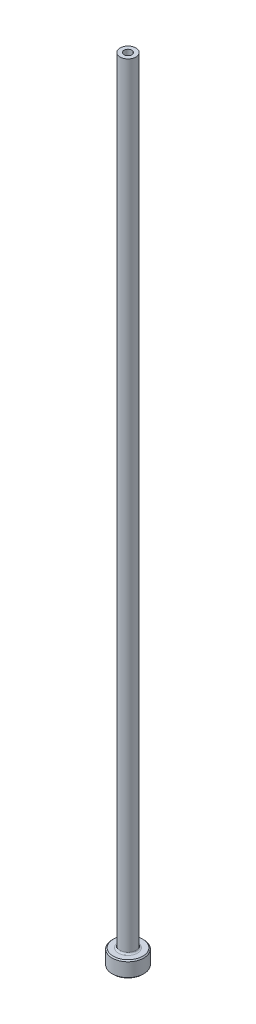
ISO-10303-21;
HEADER;
FILE_DESCRIPTION(('STEP AP214'),'2;1');
FILE_NAME('part.step','',(''),(''),'','','');
FILE_SCHEMA(('AUTOMOTIVE_DESIGN { 1 0 10303 214 1 1 1 1 }'));
ENDSEC;
DATA;
#1=APPLICATION_CONTEXT('core data for automotive mechanical design processes');
#2=APPLICATION_PROTOCOL_DEFINITION('international standard','automotive_design',2000,#1);
#3=PRODUCT_CONTEXT('',#1,'mechanical');
#4=PRODUCT('Part','Part','',(#3));
#5=PRODUCT_RELATED_PRODUCT_CATEGORY('part','',(#4));
#6=PRODUCT_DEFINITION_FORMATION('','',#4);
#7=PRODUCT_DEFINITION_CONTEXT('part definition',#1,'design');
#8=PRODUCT_DEFINITION('design','',#6,#7);
#9=PRODUCT_DEFINITION_SHAPE('','',#8);
#10=(LENGTH_UNIT() NAMED_UNIT(*) SI_UNIT(.MILLI.,.METRE.));
#11=(NAMED_UNIT(*) PLANE_ANGLE_UNIT() SI_UNIT($,.RADIAN.));
#12=(NAMED_UNIT(*) SI_UNIT($,.STERADIAN.) SOLID_ANGLE_UNIT());
#13=UNCERTAINTY_MEASURE_WITH_UNIT(LENGTH_MEASURE(1.E-05),#10,'distance_accuracy_value','');
#14=(GEOMETRIC_REPRESENTATION_CONTEXT(3) GLOBAL_UNCERTAINTY_ASSIGNED_CONTEXT((#13)) GLOBAL_UNIT_ASSIGNED_CONTEXT((#10,
#11,#12)) REPRESENTATION_CONTEXT('',''));
#15=CARTESIAN_POINT('',(0.,0.,0.));
#16=DIRECTION('',(0.,0.,1.));
#17=DIRECTION('',(1.,0.,0.));
#18=AXIS2_PLACEMENT_3D('',#15,#16,#17);
#19=CARTESIAN_POINT('',(0.,92.1876809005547,0.));
#20=DIRECTION('',(0.,1.,0.));
#21=DIRECTION('',(0.,0.,1.));
#22=AXIS2_PLACEMENT_3D('',#19,#20,#21);
#23=CYLINDRICAL_SURFACE('',#22,0.75);
#24=CARTESIAN_POINT('',(0.,150.,0.));
#25=DIRECTION('',(0.,1.,0.));
#26=DIRECTION('',(0.,0.,1.));
#27=AXIS2_PLACEMENT_3D('',#24,#25,#26);
#28=CIRCLE('',#27,0.75);
#29=CARTESIAN_POINT('',(0.,150.,0.75));
#30=VERTEX_POINT('',#29);
#31=EDGE_CURVE('E62',#30,#30,#28,.T.);
#32=ORIENTED_EDGE('',*,*,#31,.T.);
#33=EDGE_LOOP('',(#32));
#34=FACE_BOUND('',#33,.T.);
#35=CARTESIAN_POINT('',(0.,115.,0.));
#36=DIRECTION('',(0.,1.,0.));
#37=DIRECTION('',(0.,0.,1.));
#38=AXIS2_PLACEMENT_3D('',#35,#36,#37);
#39=CIRCLE('',#38,0.75);
#40=CARTESIAN_POINT('',(0.,115.,0.75));
#41=VERTEX_POINT('',#40);
#42=EDGE_CURVE('E71',#41,#41,#39,.T.);
#43=ORIENTED_EDGE('',*,*,#42,.F.);
#44=EDGE_LOOP('',(#43));
#45=FACE_BOUND('',#44,.T.);
#46=ADVANCED_FACE('F30',(#34,#45),#23,.F.);
#47=CARTESIAN_POINT('',(-0.75,150.,0.));
#48=DIRECTION('',(0.,1.,0.));
#49=DIRECTION('',(0.,0.,1.));
#50=AXIS2_PLACEMENT_3D('',#47,#48,#49);
#51=PLANE('',#50);
#52=CARTESIAN_POINT('',(0.,150.,0.));
#53=DIRECTION('',(0.,1.,0.));
#54=DIRECTION('',(0.,0.,1.));
#55=AXIS2_PLACEMENT_3D('',#52,#53,#54);
#56=CIRCLE('',#55,1.50000000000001);
#57=CARTESIAN_POINT('',(0.,150.,1.50000000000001));
#58=VERTEX_POINT('',#57);
#59=EDGE_CURVE('E65',#58,#58,#56,.T.);
#60=ORIENTED_EDGE('',*,*,#59,.T.);
#61=EDGE_LOOP('',(#60));
#62=FACE_BOUND('',#61,.T.);
#63=ORIENTED_EDGE('',*,*,#31,.F.);
#64=EDGE_LOOP('',(#63));
#65=FACE_BOUND('',#64,.T.);
#66=ADVANCED_FACE('F79',(#62,#65),#51,.T.);
#67=CARTESIAN_POINT('',(0.,92.1876809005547,0.));
#68=DIRECTION('',(0.,1.,0.));
#69=DIRECTION('',(0.,0.,1.));
#70=AXIS2_PLACEMENT_3D('',#67,#68,#69);
#71=CYLINDRICAL_SURFACE('',#70,1.5);
#72=CARTESIAN_POINT('',(0.,3.3,0.));
#73=DIRECTION('',(0.,1.,0.));
#74=DIRECTION('',(0.,0.,1.));
#75=AXIS2_PLACEMENT_3D('',#72,#73,#74);
#76=CIRCLE('',#75,1.5);
#77=CARTESIAN_POINT('',(0.,3.3,1.5));
#78=VERTEX_POINT('',#77);
#79=EDGE_CURVE('E59',#78,#78,#76,.T.);
#80=ORIENTED_EDGE('',*,*,#79,.T.);
#81=EDGE_LOOP('',(#80));
#82=FACE_BOUND('',#81,.T.);
#83=ORIENTED_EDGE('',*,*,#59,.F.);
#84=EDGE_LOOP('',(#83));
#85=FACE_BOUND('',#84,.T.);
#86=ADVANCED_FACE('F85',(#82,#85),#71,.T.);
#87=CARTESIAN_POINT('',(-1.49999999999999,3.,0.));
#88=DIRECTION('',(0.,1.,0.));
#89=DIRECTION('',(0.,0.,1.));
#90=AXIS2_PLACEMENT_3D('',#87,#88,#89);
#91=PLANE('',#90);
#92=CARTESIAN_POINT('',(0.,3.,0.));
#93=DIRECTION('',(0.,1.,0.));
#94=DIRECTION('',(0.,0.,1.));
#95=AXIS2_PLACEMENT_3D('',#92,#93,#94);
#96=CIRCLE('',#95,2.8);
#97=CARTESIAN_POINT('',(0.,3.,2.8));
#98=VERTEX_POINT('',#97);
#99=EDGE_CURVE('E53',#98,#98,#96,.T.);
#100=ORIENTED_EDGE('',*,*,#99,.T.);
#101=EDGE_LOOP('',(#100));
#102=FACE_BOUND('',#101,.T.);
#103=CARTESIAN_POINT('',(0.,3.,0.));
#104=DIRECTION('',(0.,1.,0.));
#105=DIRECTION('',(0.,0.,1.));
#106=AXIS2_PLACEMENT_3D('',#103,#104,#105);
#107=CIRCLE('',#106,1.8);
#108=CARTESIAN_POINT('',(0.,3.,1.8));
#109=VERTEX_POINT('',#108);
#110=EDGE_CURVE('E56',#109,#109,#107,.F.);
#111=ORIENTED_EDGE('',*,*,#110,.T.);
#112=EDGE_LOOP('',(#111));
#113=FACE_BOUND('',#112,.T.);
#114=ADVANCED_FACE('F111',(#102,#113),#91,.T.);
#115=CARTESIAN_POINT('',(0.,92.1876809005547,0.));
#116=DIRECTION('',(0.,1.,0.));
#117=DIRECTION('',(0.,0.,1.));
#118=AXIS2_PLACEMENT_3D('',#115,#116,#117);
#119=CYLINDRICAL_SURFACE('',#118,2.99999999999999);
#120=CARTESIAN_POINT('',(0.,2.80000000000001,0.));
#121=DIRECTION('',(0.,1.,0.));
#122=DIRECTION('',(0.,0.,1.));
#123=AXIS2_PLACEMENT_3D('',#120,#121,#122);
#124=CIRCLE('',#123,2.99999999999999);
#125=CARTESIAN_POINT('',(0.,2.80000000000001,2.99999999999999));
#126=VERTEX_POINT('',#125);
#127=EDGE_CURVE('E45',#126,#126,#124,.F.);
#128=ORIENTED_EDGE('',*,*,#127,.T.);
#129=EDGE_LOOP('',(#128));
#130=FACE_BOUND('',#129,.T.);
#131=CARTESIAN_POINT('',(0.,0.200000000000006,0.));
#132=DIRECTION('',(0.,-1.,0.));
#133=DIRECTION('',(0.,0.,-1.));
#134=AXIS2_PLACEMENT_3D('',#131,#132,#133);
#135=CIRCLE('',#134,2.99999999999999);
#136=CARTESIAN_POINT('',(0.,0.200000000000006,-2.99999999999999));
#137=VERTEX_POINT('',#136);
#138=EDGE_CURVE('E50',#137,#137,#135,.F.);
#139=ORIENTED_EDGE('',*,*,#138,.T.);
#140=EDGE_LOOP('',(#139));
#141=FACE_BOUND('',#140,.T.);
#142=ADVANCED_FACE('F108',(#130,#141),#119,.T.);
#143=CARTESIAN_POINT('',(-2.99999999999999,0.,0.));
#144=DIRECTION('',(0.,-1.,0.));
#145=DIRECTION('',(0.,0.,-1.));
#146=AXIS2_PLACEMENT_3D('',#143,#144,#145);
#147=PLANE('',#146);
#148=CARTESIAN_POINT('',(0.,0.,0.));
#149=DIRECTION('',(0.,-1.,0.));
#150=DIRECTION('',(0.,0.,-1.));
#151=AXIS2_PLACEMENT_3D('',#148,#149,#150);
#152=CIRCLE('',#151,1.49999999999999);
#153=CARTESIAN_POINT('',(0.,0.,-1.49999999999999));
#154=VERTEX_POINT('',#153);
#155=EDGE_CURVE('E37',#154,#154,#152,.F.);
#156=ORIENTED_EDGE('',*,*,#155,.T.);
#157=EDGE_LOOP('',(#156));
#158=FACE_BOUND('',#157,.T.);
#159=CARTESIAN_POINT('',(0.,0.,0.));
#160=DIRECTION('',(0.,-1.,0.));
#161=DIRECTION('',(0.,0.,-1.));
#162=AXIS2_PLACEMENT_3D('',#159,#160,#161);
#163=CIRCLE('',#162,2.79999999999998);
#164=CARTESIAN_POINT('',(0.,0.,-2.79999999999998));
#165=VERTEX_POINT('',#164);
#166=EDGE_CURVE('E41',#165,#165,#163,.T.);
#167=ORIENTED_EDGE('',*,*,#166,.T.);
#168=EDGE_LOOP('',(#167));
#169=FACE_BOUND('',#168,.T.);
#170=ADVANCED_FACE('F110',(#158,#169),#147,.T.);
#171=CARTESIAN_POINT('',(0.,92.1876809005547,0.));
#172=DIRECTION('',(0.,1.,0.));
#173=DIRECTION('',(0.,0.,1.));
#174=AXIS2_PLACEMENT_3D('',#171,#172,#173);
#175=CYLINDRICAL_SURFACE('',#174,0.999999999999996);
#176=CARTESIAN_POINT('',(0.,0.5,0.));
#177=DIRECTION('',(0.,-1.,0.));
#178=DIRECTION('',(0.,0.,-1.));
#179=AXIS2_PLACEMENT_3D('',#176,#177,#178);
#180=CIRCLE('',#179,0.999999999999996);
#181=CARTESIAN_POINT('',(0.,0.5,-0.999999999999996));
#182=VERTEX_POINT('',#181);
#183=EDGE_CURVE('E10',#182,#182,#180,.T.);
#184=ORIENTED_EDGE('',*,*,#183,.T.);
#185=EDGE_LOOP('',(#184));
#186=FACE_BOUND('',#185,.T.);
#187=CARTESIAN_POINT('',(0.,103.,0.));
#188=DIRECTION('',(0.,1.,0.));
#189=DIRECTION('',(0.,0.,1.));
#190=AXIS2_PLACEMENT_3D('',#187,#188,#189);
#191=CIRCLE('',#190,1.);
#192=CARTESIAN_POINT('',(0.,103.,1.));
#193=VERTEX_POINT('',#192);
#194=EDGE_CURVE('E68',#193,#193,#191,.T.);
#195=ORIENTED_EDGE('',*,*,#194,.T.);
#196=EDGE_LOOP('',(#195));
#197=FACE_BOUND('',#196,.T.);
#198=ADVANCED_FACE('F118',(#186,#197),#175,.F.);
#199=CARTESIAN_POINT('',(0.,103.,0.));
#200=DIRECTION('',(0.,-1.,0.));
#201=DIRECTION('',(0.,0.,-1.));
#202=AXIS2_PLACEMENT_3D('',#199,#200,#201);
#203=CONICAL_SURFACE('',#202,1.,0.0208303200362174);
#204=ORIENTED_EDGE('',*,*,#42,.T.);
#205=EDGE_LOOP('',(#204));
#206=FACE_BOUND('',#205,.T.);
#207=ORIENTED_EDGE('',*,*,#194,.F.);
#208=EDGE_LOOP('',(#207));
#209=FACE_BOUND('',#208,.T.);
#210=ADVANCED_FACE('F75',(#206,#209),#203,.F.);
#211=CARTESIAN_POINT('',(0.,3.3,0.));
#212=DIRECTION('',(0.,1.,0.));
#213=DIRECTION('',(0.,0.,1.));
#214=AXIS2_PLACEMENT_3D('',#211,#212,#213);
#215=TOROIDAL_SURFACE('',#214,1.8,0.3);
#216=ORIENTED_EDGE('',*,*,#110,.F.);
#217=EDGE_LOOP('',(#216));
#218=FACE_BOUND('',#217,.T.);
#219=ORIENTED_EDGE('',*,*,#79,.F.);
#220=EDGE_LOOP('',(#219));
#221=FACE_BOUND('',#220,.T.);
#222=ADVANCED_FACE('F90',(#218,#221),#215,.F.);
#223=CARTESIAN_POINT('',(0.,3.,0.));
#224=DIRECTION('',(0.,-1.,0.));
#225=DIRECTION('',(0.,0.,-1.));
#226=AXIS2_PLACEMENT_3D('',#223,#224,#225);
#227=CONICAL_SURFACE('',#226,2.8,0.785398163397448);
#228=ORIENTED_EDGE('',*,*,#127,.F.);
#229=EDGE_LOOP('',(#228));
#230=FACE_BOUND('',#229,.T.);
#231=ORIENTED_EDGE('',*,*,#99,.F.);
#232=EDGE_LOOP('',(#231));
#233=FACE_BOUND('',#232,.T.);
#234=ADVANCED_FACE('F93',(#230,#233),#227,.T.);
#235=CARTESIAN_POINT('',(0.,0.200000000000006,0.));
#236=DIRECTION('',(0.,1.,0.));
#237=DIRECTION('',(0.,0.,1.));
#238=AXIS2_PLACEMENT_3D('',#235,#236,#237);
#239=CONICAL_SURFACE('',#238,2.99999999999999,0.785398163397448);
#240=ORIENTED_EDGE('',*,*,#166,.F.);
#241=EDGE_LOOP('',(#240));
#242=FACE_BOUND('',#241,.T.);
#243=ORIENTED_EDGE('',*,*,#138,.F.);
#244=EDGE_LOOP('',(#243));
#245=FACE_BOUND('',#244,.T.);
#246=ADVANCED_FACE('F96',(#242,#245),#239,.T.);
#247=CARTESIAN_POINT('',(0.,0.,0.));
#248=DIRECTION('',(0.,-1.,0.));
#249=DIRECTION('',(0.,0.,-1.));
#250=AXIS2_PLACEMENT_3D('',#247,#248,#249);
#251=CONICAL_SURFACE('',#250,1.49999999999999,0.785398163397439);
#252=ORIENTED_EDGE('',*,*,#183,.F.);
#253=EDGE_LOOP('',(#252));
#254=FACE_BOUND('',#253,.T.);
#255=ORIENTED_EDGE('',*,*,#155,.F.);
#256=EDGE_LOOP('',(#255));
#257=FACE_BOUND('',#256,.T.);
#258=ADVANCED_FACE('F32',(#254,#257),#251,.F.);
#259=CLOSED_SHELL('',(#46,#66,#86,#114,#142,#170,#198,#210,#222,#234,#246,#258));
#260=MANIFOLD_SOLID_BREP('B2',#259);
#261=ADVANCED_BREP_SHAPE_REPRESENTATION('',(#18,#260),#14);
#262=SHAPE_DEFINITION_REPRESENTATION(#9,#261);
ENDSEC;
END-ISO-10303-21;
